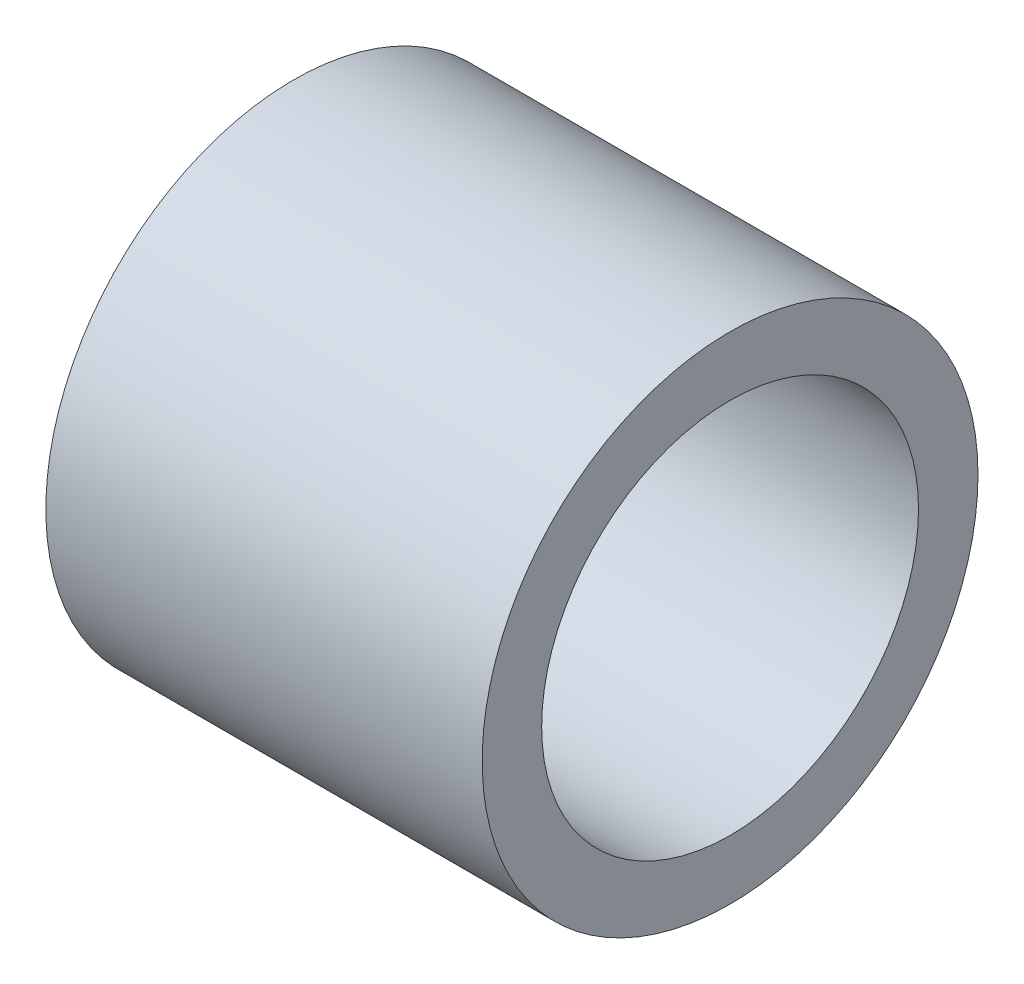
ISO-10303-21;
HEADER;
FILE_DESCRIPTION(('STEP AP214'),'2;1');
FILE_NAME('part.step','',(''),(''),'','','');
FILE_SCHEMA(('AUTOMOTIVE_DESIGN { 1 0 10303 214 1 1 1 1 }'));
ENDSEC;
DATA;
#1=APPLICATION_CONTEXT('core data for automotive mechanical design processes');
#2=APPLICATION_PROTOCOL_DEFINITION('international standard','automotive_design',2000,#1);
#3=PRODUCT_CONTEXT('',#1,'mechanical');
#4=PRODUCT('Part','Part','',(#3));
#5=PRODUCT_RELATED_PRODUCT_CATEGORY('part','',(#4));
#6=PRODUCT_DEFINITION_FORMATION('','',#4);
#7=PRODUCT_DEFINITION_CONTEXT('part definition',#1,'design');
#8=PRODUCT_DEFINITION('design','',#6,#7);
#9=PRODUCT_DEFINITION_SHAPE('','',#8);
#10=(LENGTH_UNIT() NAMED_UNIT(*) SI_UNIT(.MILLI.,.METRE.));
#11=(NAMED_UNIT(*) PLANE_ANGLE_UNIT() SI_UNIT($,.RADIAN.));
#12=(NAMED_UNIT(*) SI_UNIT($,.STERADIAN.) SOLID_ANGLE_UNIT());
#13=UNCERTAINTY_MEASURE_WITH_UNIT(LENGTH_MEASURE(1.E-05),#10,'distance_accuracy_value','');
#14=(GEOMETRIC_REPRESENTATION_CONTEXT(3) GLOBAL_UNCERTAINTY_ASSIGNED_CONTEXT((#13)) GLOBAL_UNIT_ASSIGNED_CONTEXT((#10,
#11,#12)) REPRESENTATION_CONTEXT('',''));
#15=CARTESIAN_POINT('',(0.,0.,0.));
#16=DIRECTION('',(0.,0.,1.));
#17=DIRECTION('',(1.,0.,0.));
#18=AXIS2_PLACEMENT_3D('',#15,#16,#17);
#19=CARTESIAN_POINT('',(53.9750000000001,0.,0.));
#20=DIRECTION('',(1.,0.,0.));
#21=DIRECTION('',(0.,-1.,0.));
#22=AXIS2_PLACEMENT_3D('',#19,#20,#21);
#23=CYLINDRICAL_SURFACE('',#22,2.413);
#24=CARTESIAN_POINT('',(153.797,-1.25589390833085E-13,0.));
#25=DIRECTION('',(1.,0.,0.));
#26=DIRECTION('',(0.,0.,-1.));
#27=AXIS2_PLACEMENT_3D('',#24,#25,#26);
#28=CIRCLE('',#27,2.413);
#29=CARTESIAN_POINT('',(153.797,-1.25589390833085E-13,-2.41300000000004));
#30=VERTEX_POINT('',#29);
#31=EDGE_CURVE('E46',#30,#30,#28,.F.);
#32=ORIENTED_EDGE('',*,*,#31,.T.);
#33=EDGE_LOOP('',(#32));
#34=FACE_BOUND('',#33,.T.);
#35=CARTESIAN_POINT('',(159.385,1.14792013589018E-13,1.3187140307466E-13));
#36=DIRECTION('',(1.,0.,0.));
#37=DIRECTION('',(0.,0.,1.));
#38=AXIS2_PLACEMENT_3D('',#35,#36,#37);
#39=CIRCLE('',#38,2.413);
#40=CARTESIAN_POINT('',(159.385,1.07666105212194E-13,2.41300000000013));
#41=VERTEX_POINT('',#40);
#42=EDGE_CURVE('E36',#41,#41,#39,.T.);
#43=ORIENTED_EDGE('',*,*,#42,.T.);
#44=EDGE_LOOP('',(#43));
#45=FACE_BOUND('',#44,.T.);
#46=ADVANCED_FACE('F33',(#34,#45),#23,.F.);
#47=CARTESIAN_POINT('',(153.797,0.,1.18754493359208E-13));
#48=DIRECTION('',(1.,0.,0.));
#49=DIRECTION('',(0.,0.,1.));
#50=AXIS2_PLACEMENT_3D('',#47,#48,#49);
#51=PLANE('',#50);
#52=ORIENTED_EDGE('',*,*,#31,.F.);
#53=EDGE_LOOP('',(#52));
#54=FACE_BOUND('',#53,.T.);
#55=CARTESIAN_POINT('',(153.797,1.08662426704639E-13,1.91070035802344E-13));
#56=DIRECTION('',(1.,0.,0.));
#57=DIRECTION('',(0.,0.,-1.));
#58=AXIS2_PLACEMENT_3D('',#55,#56,#57);
#59=CIRCLE('',#58,3.175);
#60=CARTESIAN_POINT('',(153.797,1.08662426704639E-13,-3.17499999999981));
#61=VERTEX_POINT('',#60);
#62=EDGE_CURVE('E40',#61,#61,#59,.F.);
#63=ORIENTED_EDGE('',*,*,#62,.T.);
#64=EDGE_LOOP('',(#63));
#65=FACE_BOUND('',#64,.T.);
#66=ADVANCED_FACE('F62',(#54,#65),#51,.F.);
#67=CARTESIAN_POINT('',(159.385,1.07853119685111E-13,1.90852001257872E-13));
#68=DIRECTION('',(-1.,0.,0.));
#69=DIRECTION('',(0.,0.,-0.999999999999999));
#70=AXIS2_PLACEMENT_3D('',#67,#68,#69);
#71=CYLINDRICAL_SURFACE('',#70,3.175);
#72=CARTESIAN_POINT('',(159.385,1.07853119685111E-13,1.90852001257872E-13));
#73=DIRECTION('',(1.,0.,0.));
#74=DIRECTION('',(0.,0.,-1.));
#75=AXIS2_PLACEMENT_3D('',#72,#73,#74);
#76=CIRCLE('',#75,3.175);
#77=CARTESIAN_POINT('',(159.385,1.07853119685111E-13,-3.17499999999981));
#78=VERTEX_POINT('',#77);
#79=EDGE_CURVE('E10',#78,#78,#76,.T.);
#80=ORIENTED_EDGE('',*,*,#79,.F.);
#81=EDGE_LOOP('',(#80));
#82=FACE_BOUND('',#81,.T.);
#83=ORIENTED_EDGE('',*,*,#62,.F.);
#84=EDGE_LOOP('',(#83));
#85=FACE_BOUND('',#84,.T.);
#86=ADVANCED_FACE('F56',(#82,#85),#71,.T.);
#87=CARTESIAN_POINT('',(159.385,1.14792013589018E-13,1.3187140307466E-13));
#88=DIRECTION('',(1.,0.,0.));
#89=DIRECTION('',(0.,0.,1.));
#90=AXIS2_PLACEMENT_3D('',#87,#88,#89);
#91=PLANE('',#90);
#92=ORIENTED_EDGE('',*,*,#42,.F.);
#93=EDGE_LOOP('',(#92));
#94=FACE_BOUND('',#93,.T.);
#95=ORIENTED_EDGE('',*,*,#79,.T.);
#96=EDGE_LOOP('',(#95));
#97=FACE_BOUND('',#96,.T.);
#98=ADVANCED_FACE('F54',(#94,#97),#91,.T.);
#99=CLOSED_SHELL('',(#46,#66,#86,#98));
#100=MANIFOLD_SOLID_BREP('B2',#99);
#101=ADVANCED_BREP_SHAPE_REPRESENTATION('',(#18,#100),#14);
#102=SHAPE_DEFINITION_REPRESENTATION(#9,#101);
ENDSEC;
END-ISO-10303-21;
